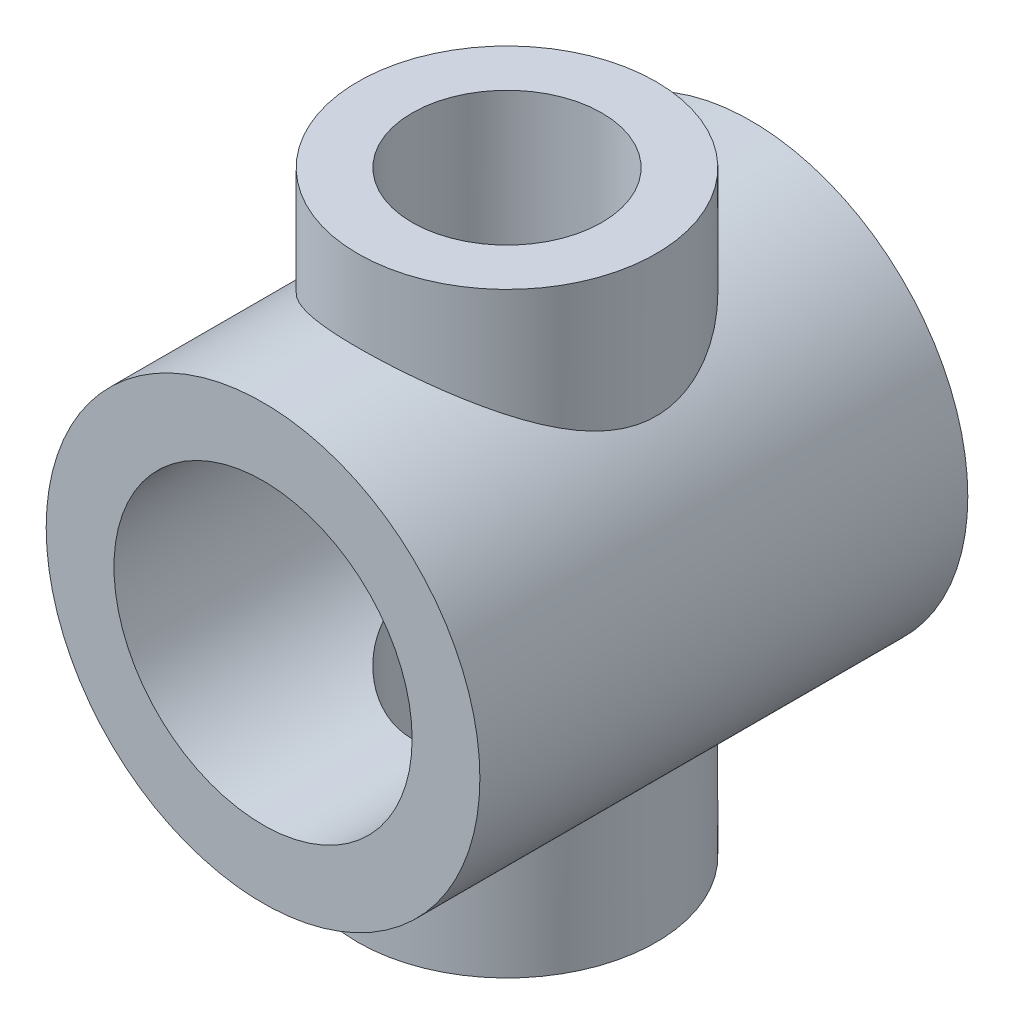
ISO-10303-21;
HEADER;
FILE_DESCRIPTION(('STEP AP214'),'2;1');
FILE_NAME('part.step','',(''),(''),'','','');
FILE_SCHEMA(('AUTOMOTIVE_DESIGN { 1 0 10303 214 1 1 1 1 }'));
ENDSEC;
DATA;
#1=APPLICATION_CONTEXT('core data for automotive mechanical design processes');
#2=APPLICATION_PROTOCOL_DEFINITION('international standard','automotive_design',2000,#1);
#3=PRODUCT_CONTEXT('',#1,'mechanical');
#4=PRODUCT('Part','Part','',(#3));
#5=PRODUCT_RELATED_PRODUCT_CATEGORY('part','',(#4));
#6=PRODUCT_DEFINITION_FORMATION('','',#4);
#7=PRODUCT_DEFINITION_CONTEXT('part definition',#1,'design');
#8=PRODUCT_DEFINITION('design','',#6,#7);
#9=PRODUCT_DEFINITION_SHAPE('','',#8);
#10=(LENGTH_UNIT() NAMED_UNIT(*) SI_UNIT(.MILLI.,.METRE.));
#11=(NAMED_UNIT(*) PLANE_ANGLE_UNIT() SI_UNIT($,.RADIAN.));
#12=(NAMED_UNIT(*) SI_UNIT($,.STERADIAN.) SOLID_ANGLE_UNIT());
#13=UNCERTAINTY_MEASURE_WITH_UNIT(LENGTH_MEASURE(1.E-05),#10,'distance_accuracy_value','');
#14=(GEOMETRIC_REPRESENTATION_CONTEXT(3) GLOBAL_UNCERTAINTY_ASSIGNED_CONTEXT((#13)) GLOBAL_UNIT_ASSIGNED_CONTEXT((#10,
#11,#12)) REPRESENTATION_CONTEXT('',''));
#15=CARTESIAN_POINT('',(0.,0.,0.));
#16=DIRECTION('',(0.,0.,1.));
#17=DIRECTION('',(1.,0.,0.));
#18=AXIS2_PLACEMENT_3D('',#15,#16,#17);
#19=CARTESIAN_POINT('',(0.,0.,18.));
#20=DIRECTION('',(0.,0.,1.));
#21=DIRECTION('',(1.,0.,0.));
#22=AXIS2_PLACEMENT_3D('',#19,#20,#21);
#23=PLANE('',#22);
#24=CARTESIAN_POINT('',(0.,0.,18.));
#25=DIRECTION('',(0.,0.,1.));
#26=DIRECTION('',(1.,0.,0.));
#27=AXIS2_PLACEMENT_3D('',#24,#25,#26);
#28=CIRCLE('',#27,8.);
#29=CARTESIAN_POINT('',(8.,0.,18.));
#30=VERTEX_POINT('',#29);
#31=EDGE_CURVE('E47',#30,#30,#28,.T.);
#32=ORIENTED_EDGE('',*,*,#31,.T.);
#33=EDGE_LOOP('',(#32));
#34=FACE_BOUND('',#33,.T.);
#35=CARTESIAN_POINT('',(0.,0.,18.));
#36=DIRECTION('',(0.,0.,1.));
#37=DIRECTION('',(1.,0.,0.));
#38=AXIS2_PLACEMENT_3D('',#35,#36,#37);
#39=CIRCLE('',#38,5.5);
#40=CARTESIAN_POINT('',(5.5,0.,18.));
#41=VERTEX_POINT('',#40);
#42=EDGE_CURVE('E91',#41,#41,#39,.F.);
#43=ORIENTED_EDGE('',*,*,#42,.T.);
#44=EDGE_LOOP('',(#43));
#45=FACE_BOUND('',#44,.T.);
#46=ADVANCED_FACE('F29',(#34,#45),#23,.T.);
#47=CARTESIAN_POINT('',(0.,0.,0.));
#48=DIRECTION('',(0.,0.,1.));
#49=DIRECTION('',(1.,0.,0.));
#50=AXIS2_PLACEMENT_3D('',#47,#48,#49);
#51=PLANE('',#50);
#52=CARTESIAN_POINT('',(0.,0.,0.));
#53=DIRECTION('',(0.,0.,1.));
#54=DIRECTION('',(1.,0.,0.));
#55=AXIS2_PLACEMENT_3D('',#52,#53,#54);
#56=CIRCLE('',#55,8.);
#57=CARTESIAN_POINT('',(8.,0.,0.));
#58=VERTEX_POINT('',#57);
#59=EDGE_CURVE('E82',#58,#58,#56,.T.);
#60=ORIENTED_EDGE('',*,*,#59,.F.);
#61=EDGE_LOOP('',(#60));
#62=FACE_BOUND('',#61,.T.);
#63=CARTESIAN_POINT('',(0.,0.,0.));
#64=DIRECTION('',(0.,0.,1.));
#65=DIRECTION('',(1.,0.,0.));
#66=AXIS2_PLACEMENT_3D('',#63,#64,#65);
#67=CIRCLE('',#66,5.5);
#68=CARTESIAN_POINT('',(5.5,0.,0.));
#69=VERTEX_POINT('',#68);
#70=EDGE_CURVE('E85',#69,#69,#67,.T.);
#71=ORIENTED_EDGE('',*,*,#70,.T.);
#72=EDGE_LOOP('',(#71));
#73=FACE_BOUND('',#72,.T.);
#74=ADVANCED_FACE('F69',(#62,#73),#51,.F.);
#75=CARTESIAN_POINT('',(0.,16.,9.));
#76=DIRECTION('',(0.,-1.,0.));
#77=DIRECTION('',(0.,0.,-1.));
#78=AXIS2_PLACEMENT_3D('',#75,#76,#77);
#79=CYLINDRICAL_SURFACE('',#78,3.5);
#80=CARTESIAN_POINT('',(0.,11.,9.));
#81=DIRECTION('',(0.,1.,0.));
#82=DIRECTION('',(0.,0.,1.));
#83=AXIS2_PLACEMENT_3D('',#80,#81,#82);
#84=CIRCLE('',#83,3.5);
#85=CARTESIAN_POINT('',(0.,11.,12.5));
#86=VERTEX_POINT('',#85);
#87=EDGE_CURVE('E56',#86,#86,#84,.F.);
#88=ORIENTED_EDGE('',*,*,#87,.F.);
#89=EDGE_LOOP('',(#88));
#90=FACE_BOUND('',#89,.T.);
#91=CARTESIAN_POINT('',(0.,5.5,5.5));
#92=CARTESIAN_POINT('',(0.088668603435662,5.50000008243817,5.49999990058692));
#93=CARTESIAN_POINT('',(0.177336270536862,5.49785112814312,5.50337387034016));
#94=CARTESIAN_POINT('',(0.35398798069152,5.48930931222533,5.51681993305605));
#95=CARTESIAN_POINT('',(0.441971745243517,5.48291480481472,5.52689462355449));
#96=CARTESIAN_POINT('',(0.616651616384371,5.4660265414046,5.55361720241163));
#97=CARTESIAN_POINT('',(0.703345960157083,5.45552762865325,5.5702733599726));
#98=CARTESIAN_POINT('',(0.874723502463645,5.43068827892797,5.60992482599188));
#99=CARTESIAN_POINT('',(0.959405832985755,5.41634621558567,5.63292281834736));
#100=CARTESIAN_POINT('',(1.20866950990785,5.36819841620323,5.71073859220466));
#101=CARTESIAN_POINT('',(1.36954145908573,5.32916121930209,5.77454692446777));
#102=CARTESIAN_POINT('',(1.67761743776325,5.2403620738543,5.92348333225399));
#103=CARTESIAN_POINT('',(1.82482247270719,5.19060091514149,6.0086098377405));
#104=CARTESIAN_POINT('',(2.11504296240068,5.07962805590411,6.20540306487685));
#105=CARTESIAN_POINT('',(2.25674426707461,5.01781426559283,6.31866509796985));
#106=CARTESIAN_POINT('',(2.5204037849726,4.89071017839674,6.56480711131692));
#107=CARTESIAN_POINT('',(2.64233436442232,4.82541518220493,6.69771406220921));
#108=CARTESIAN_POINT('',(2.88057352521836,4.68761830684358,7.00133879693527));
#109=CARTESIAN_POINT('',(2.99364844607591,4.6154031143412,7.17474570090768));
#110=CARTESIAN_POINT('',(3.18876354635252,4.48282648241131,7.54230098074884));
#111=CARTESIAN_POINT('',(3.27085680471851,4.42244485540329,7.73641314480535));
#112=CARTESIAN_POINT('',(3.38247193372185,4.33733050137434,8.08724886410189));
#113=CARTESIAN_POINT('',(3.42018119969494,4.3073828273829,8.24009286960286));
#114=CARTESIAN_POINT('',(3.47474629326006,4.26349663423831,8.55161284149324));
#115=CARTESIAN_POINT('',(3.49163325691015,4.24953421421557,8.71027973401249));
#116=CARTESIAN_POINT('',(3.50352792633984,4.2397366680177,9.02948921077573));
#117=CARTESIAN_POINT('',(3.49847060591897,4.24395541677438,9.1900359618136));
#118=CARTESIAN_POINT('',(3.46668215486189,4.26995361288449,9.5075649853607));
#119=CARTESIAN_POINT('',(3.43993325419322,4.29174745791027,9.66454422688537));
#120=CARTESIAN_POINT('',(3.36739264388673,4.34887279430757,9.9665079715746));
#121=CARTESIAN_POINT('',(3.32215570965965,4.38380771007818,10.1117053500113));
#122=CARTESIAN_POINT('',(3.21450524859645,4.46334231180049,10.3927034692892));
#123=CARTESIAN_POINT('',(3.15208598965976,4.50794522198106,10.5285010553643));
#124=CARTESIAN_POINT('',(2.99810117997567,4.61211256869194,10.8145527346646));
#125=CARTESIAN_POINT('',(2.90324164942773,4.67290582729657,10.9625843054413));
#126=CARTESIAN_POINT('',(2.6930915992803,4.79710231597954,11.242300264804));
#127=CARTESIAN_POINT('',(2.57777706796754,4.86050854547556,11.3739651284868));
#128=CARTESIAN_POINT('',(2.30583053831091,4.99601149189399,11.6411465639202));
#129=CARTESIAN_POINT('',(2.14549762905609,5.06764464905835,11.7731724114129));
#130=CARTESIAN_POINT('',(1.80093670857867,5.20005500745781,12.0083201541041));
#131=CARTESIAN_POINT('',(1.61673485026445,5.26084391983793,12.1114732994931));
#132=CARTESIAN_POINT('',(1.26705943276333,5.35448908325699,12.2670449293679));
#133=CARTESIAN_POINT('',(1.10509863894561,5.39049279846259,12.3254647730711));
#134=CARTESIAN_POINT('',(0.771986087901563,5.44816731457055,12.418165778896));
#135=CARTESIAN_POINT('',(0.600841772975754,5.46984953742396,12.4524661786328));
#136=CARTESIAN_POINT('',(0.253479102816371,5.4969246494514,12.4952050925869));
#137=CARTESIAN_POINT('',(0.0772461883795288,5.50226488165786,12.503560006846));
#138=CARTESIAN_POINT('',(-0.274174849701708,5.49597220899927,12.4936693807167));
#139=CARTESIAN_POINT('',(-0.449362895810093,5.48433805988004,12.4754218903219));
#140=CARTESIAN_POINT('',(-0.784463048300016,5.44624957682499,12.4149880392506));
#141=CARTESIAN_POINT('',(-0.944698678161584,5.42058062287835,12.3740688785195));
#142=CARTESIAN_POINT('',(-1.25563623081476,5.3571058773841,12.2711193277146));
#143=CARTESIAN_POINT('',(-1.40633654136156,5.31929803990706,12.2090853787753));
#144=CARTESIAN_POINT('',(-1.70652898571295,5.23106686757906,12.0607008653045));
#145=CARTESIAN_POINT('',(-1.85506429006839,5.17990468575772,11.9728639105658));
#146=CARTESIAN_POINT('',(-2.13602585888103,5.07051967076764,11.7778925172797));
#147=CARTESIAN_POINT('',(-2.26843914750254,5.01229122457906,11.6707427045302));
#148=CARTESIAN_POINT('',(-2.53447291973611,4.88379191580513,11.4216729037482));
#149=CARTESIAN_POINT('',(-2.66523578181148,4.8130332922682,11.2769444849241));
#150=CARTESIAN_POINT('',(-2.90158167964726,4.67435535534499,10.9669385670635));
#151=CARTESIAN_POINT('',(-3.00716132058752,4.60643642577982,10.8016583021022));
#152=CARTESIAN_POINT('',(-3.17751005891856,4.4902705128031,10.4771598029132));
#153=CARTESIAN_POINT('',(-3.24594376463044,4.44059968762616,10.3204075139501));
#154=CARTESIAN_POINT('',(-3.33139037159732,4.37642621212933,10.0766884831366));
#155=CARTESIAN_POINT('',(-3.35700338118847,4.35675877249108,9.99402658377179));
#156=CARTESIAN_POINT('',(-3.40218939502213,4.32156554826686,9.82622422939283));
#157=CARTESIAN_POINT('',(-3.42176535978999,4.30603773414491,9.74108501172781));
#158=CARTESIAN_POINT('',(-3.45473439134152,4.27963354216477,9.56801845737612));
#159=CARTESIAN_POINT('',(-3.46806529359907,4.26880400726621,9.48007202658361));
#160=CARTESIAN_POINT('',(-3.48800076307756,4.25253069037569,9.30296374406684));
#161=CARTESIAN_POINT('',(-3.49460872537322,4.24708418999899,9.21380252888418));
#162=CARTESIAN_POINT('',(-3.5009651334,4.2418466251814,9.03508778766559));
#163=CARTESIAN_POINT('',(-3.50071552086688,4.24205395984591,8.94553437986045));
#164=CARTESIAN_POINT('',(-3.4933764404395,4.24809784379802,8.76692843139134));
#165=CARTESIAN_POINT('',(-3.48628746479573,4.25393398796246,8.67787585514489));
#166=CARTESIAN_POINT('',(-3.45784465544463,4.27713646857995,8.4371896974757));
#167=CARTESIAN_POINT('',(-3.42988773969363,4.29978471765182,8.28678160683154));
#168=CARTESIAN_POINT('',(-3.35552745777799,4.35805222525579,7.99329374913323));
#169=CARTESIAN_POINT('',(-3.30910629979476,4.39368399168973,7.85022120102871));
#170=CARTESIAN_POINT('',(-3.18061171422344,4.48798778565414,7.52562386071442));
#171=CARTESIAN_POINT('',(-3.09176409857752,4.5503678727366,7.3478528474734));
#172=CARTESIAN_POINT('',(-2.88713957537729,4.68287158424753,7.01171982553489));
#173=CARTESIAN_POINT('',(-2.77132653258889,4.75300553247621,6.85338430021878));
#174=CARTESIAN_POINT('',(-2.51365586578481,4.89422020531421,6.55652140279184));
#175=CARTESIAN_POINT('',(-2.37152263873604,4.96530277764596,6.41823418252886));
#176=CARTESIAN_POINT('',(-2.06384330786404,5.10085482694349,6.16627609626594));
#177=CARTESIAN_POINT('',(-1.89829729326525,5.16532432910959,6.05260513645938));
#178=CARTESIAN_POINT('',(-1.63241263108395,5.25302861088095,5.90225892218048));
#179=CARTESIAN_POINT('',(-1.53949582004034,5.28107349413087,5.85501633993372));
#180=CARTESIAN_POINT('',(-1.34885332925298,5.33294738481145,5.76866503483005));
#181=CARTESIAN_POINT('',(-1.251130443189,5.35677880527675,5.72955165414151));
#182=CARTESIAN_POINT('',(-1.05182946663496,5.39944616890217,5.66012492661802));
#183=CARTESIAN_POINT('',(-0.950261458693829,5.41829426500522,5.62979015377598));
#184=CARTESIAN_POINT('',(-0.74401504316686,5.45044196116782,5.57834506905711));
#185=CARTESIAN_POINT('',(-0.639338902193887,5.46374550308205,5.55722820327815));
#186=CARTESIAN_POINT('',(-0.445661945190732,5.48262773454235,5.52734754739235));
#187=CARTESIAN_POINT('',(-0.356975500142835,5.48912762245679,5.51710621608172));
#188=CARTESIAN_POINT('',(-0.178859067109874,5.49781377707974,5.50343239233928));
#189=CARTESIAN_POINT('',(-0.0894290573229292,5.49999991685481,5.50000010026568));
#190=CARTESIAN_POINT('',(0.,5.5,5.5));
#191=B_SPLINE_CURVE_WITH_KNOTS('',3,(#91,#92,#93,#94,#95,#96,#97,#98,#99,#100,#101,#102,#103,
#104,#105,#106,#107,#108,#109,#110,#111,#112,#113,#114,#115,#116,#117,#118,#119,#120,#121,#122,
#123,#124,#125,#126,#127,#128,#129,#130,#131,#132,#133,#134,#135,#136,#137,#138,#139,#140,#141,
#142,#143,#144,#145,#146,#147,#148,#149,#150,#151,#152,#153,#154,#155,#156,#157,#158,#159,#160,
#161,#162,#163,#164,#165,#166,#167,#168,#169,#170,#171,#172,#173,#174,#175,#176,#177,#178,#179,
#180,#181,#182,#183,#184,#185,#186,#187,#188,#189,#190),.UNSPECIFIED.,.T.,.F.,(4,2,2,2,2,2,2,2,
2,2,2,2,2,2,2,2,2,2,2,2,2,2,2,2,2,2,2,2,2,2,2,2,2,2,2,2,2,2,2,2,2,2,2,2,2,2,2,2,2,4),(0.,
0.265914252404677,0.531931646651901,0.798284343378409,1.06474993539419,1.59444535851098,
2.12410178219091,2.69682977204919,3.27035149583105,3.92498112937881,4.57848407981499,
5.05726289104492,5.53532490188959,6.01480449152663,6.49467727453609,6.96109947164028,
7.42767745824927,7.98374091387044,8.54046149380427,9.19633860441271,9.85150306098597,
10.3769507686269,10.9019789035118,11.4286970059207,11.9554537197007,12.4553692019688,
12.9553689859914,13.4932558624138,14.0315728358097,14.6514632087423,15.2714370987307,
15.8034651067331,16.0694207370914,16.3352457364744,16.6036633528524,16.8719453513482,
17.1401513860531,17.4083381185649,17.870104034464,18.3323159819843,18.9539188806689,
19.57635960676,20.2057300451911,20.8350980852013,21.1585188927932,21.4817538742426,
21.8041931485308,22.1264027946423,22.394589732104,22.6627845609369),.UNSPECIFIED.);
#192=CARTESIAN_POINT('',(0.,5.5,5.5));
#193=VERTEX_POINT('',#192);
#194=EDGE_CURVE('E34',#193,#193,#191,.T.);
#195=ORIENTED_EDGE('',*,*,#194,.T.);
#196=EDGE_LOOP('',(#195));
#197=FACE_BOUND('',#196,.T.);
#198=ADVANCED_FACE('F72',(#90,#197),#79,.F.);
#199=CARTESIAN_POINT('',(0.,-11.,9.));
#200=DIRECTION('',(0.,1.,0.));
#201=DIRECTION('',(0.,0.,1.));
#202=AXIS2_PLACEMENT_3D('',#199,#200,#201);
#203=CIRCLE('',#202,3.5);
#204=CARTESIAN_POINT('',(0.,-11.,12.5));
#205=VERTEX_POINT('',#204);
#206=EDGE_CURVE('E94',#205,#205,#203,.F.);
#207=ORIENTED_EDGE('',*,*,#206,.T.);
#208=EDGE_LOOP('',(#207));
#209=FACE_BOUND('',#208,.T.);
#210=CARTESIAN_POINT('',(0.,-5.5,5.5));
#211=CARTESIAN_POINT('',(-0.088668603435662,-5.50000008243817,5.49999990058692));
#212=CARTESIAN_POINT('',(-0.177336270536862,-5.49785112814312,5.50337387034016));
#213=CARTESIAN_POINT('',(-0.35398798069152,-5.48930931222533,5.51681993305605));
#214=CARTESIAN_POINT('',(-0.441971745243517,-5.48291480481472,5.52689462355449));
#215=CARTESIAN_POINT('',(-0.616651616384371,-5.4660265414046,5.55361720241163));
#216=CARTESIAN_POINT('',(-0.703345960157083,-5.45552762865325,5.5702733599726));
#217=CARTESIAN_POINT('',(-0.874723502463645,-5.43068827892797,5.60992482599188));
#218=CARTESIAN_POINT('',(-0.959405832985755,-5.41634621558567,5.63292281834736));
#219=CARTESIAN_POINT('',(-1.20866950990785,-5.36819841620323,5.71073859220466));
#220=CARTESIAN_POINT('',(-1.36954145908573,-5.32916121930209,5.77454692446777));
#221=CARTESIAN_POINT('',(-1.67761743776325,-5.2403620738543,5.92348333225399));
#222=CARTESIAN_POINT('',(-1.82482247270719,-5.19060091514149,6.0086098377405));
#223=CARTESIAN_POINT('',(-2.11504296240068,-5.07962805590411,6.20540306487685));
#224=CARTESIAN_POINT('',(-2.25674426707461,-5.01781426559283,6.31866509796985));
#225=CARTESIAN_POINT('',(-2.5204037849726,-4.89071017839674,6.56480711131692));
#226=CARTESIAN_POINT('',(-2.64233436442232,-4.82541518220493,6.69771406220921));
#227=CARTESIAN_POINT('',(-2.88057352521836,-4.68761830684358,7.00133879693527));
#228=CARTESIAN_POINT('',(-2.99364844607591,-4.6154031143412,7.17474570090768));
#229=CARTESIAN_POINT('',(-3.18876354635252,-4.48282648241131,7.54230098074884));
#230=CARTESIAN_POINT('',(-3.27085680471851,-4.42244485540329,7.73641314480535));
#231=CARTESIAN_POINT('',(-3.38247193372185,-4.33733050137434,8.08724886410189));
#232=CARTESIAN_POINT('',(-3.42018119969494,-4.3073828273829,8.24009286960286));
#233=CARTESIAN_POINT('',(-3.47474629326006,-4.26349663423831,8.55161284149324));
#234=CARTESIAN_POINT('',(-3.49163325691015,-4.24953421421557,8.71027973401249));
#235=CARTESIAN_POINT('',(-3.50352792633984,-4.2397366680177,9.02948921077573));
#236=CARTESIAN_POINT('',(-3.49847060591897,-4.24395541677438,9.1900359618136));
#237=CARTESIAN_POINT('',(-3.46668215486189,-4.26995361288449,9.5075649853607));
#238=CARTESIAN_POINT('',(-3.43993325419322,-4.29174745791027,9.66454422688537));
#239=CARTESIAN_POINT('',(-3.36739264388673,-4.34887279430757,9.9665079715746));
#240=CARTESIAN_POINT('',(-3.32215570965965,-4.38380771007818,10.1117053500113));
#241=CARTESIAN_POINT('',(-3.21450524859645,-4.46334231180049,10.3927034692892));
#242=CARTESIAN_POINT('',(-3.15208598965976,-4.50794522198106,10.5285010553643));
#243=CARTESIAN_POINT('',(-2.99810117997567,-4.61211256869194,10.8145527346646));
#244=CARTESIAN_POINT('',(-2.90324164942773,-4.67290582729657,10.9625843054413));
#245=CARTESIAN_POINT('',(-2.6930915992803,-4.79710231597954,11.242300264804));
#246=CARTESIAN_POINT('',(-2.57777706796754,-4.86050854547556,11.3739651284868));
#247=CARTESIAN_POINT('',(-2.30583053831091,-4.99601149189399,11.6411465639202));
#248=CARTESIAN_POINT('',(-2.14549762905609,-5.06764464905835,11.7731724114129));
#249=CARTESIAN_POINT('',(-1.80093670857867,-5.20005500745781,12.0083201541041));
#250=CARTESIAN_POINT('',(-1.61673485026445,-5.26084391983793,12.1114732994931));
#251=CARTESIAN_POINT('',(-1.26705943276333,-5.35448908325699,12.2670449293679));
#252=CARTESIAN_POINT('',(-1.10509863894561,-5.39049279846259,12.3254647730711));
#253=CARTESIAN_POINT('',(-0.771986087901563,-5.44816731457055,12.418165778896));
#254=CARTESIAN_POINT('',(-0.600841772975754,-5.46984953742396,12.4524661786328));
#255=CARTESIAN_POINT('',(-0.253479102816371,-5.4969246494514,12.4952050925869));
#256=CARTESIAN_POINT('',(-0.0772461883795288,-5.50226488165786,12.503560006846));
#257=CARTESIAN_POINT('',(0.274174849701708,-5.49597220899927,12.4936693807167));
#258=CARTESIAN_POINT('',(0.449362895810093,-5.48433805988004,12.4754218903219));
#259=CARTESIAN_POINT('',(0.784463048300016,-5.44624957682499,12.4149880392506));
#260=CARTESIAN_POINT('',(0.944698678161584,-5.42058062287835,12.3740688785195));
#261=CARTESIAN_POINT('',(1.25563623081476,-5.3571058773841,12.2711193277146));
#262=CARTESIAN_POINT('',(1.40633654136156,-5.31929803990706,12.2090853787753));
#263=CARTESIAN_POINT('',(1.70652898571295,-5.23106686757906,12.0607008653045));
#264=CARTESIAN_POINT('',(1.85506429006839,-5.17990468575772,11.9728639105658));
#265=CARTESIAN_POINT('',(2.13602585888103,-5.07051967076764,11.7778925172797));
#266=CARTESIAN_POINT('',(2.26843914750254,-5.01229122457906,11.6707427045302));
#267=CARTESIAN_POINT('',(2.53447291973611,-4.88379191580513,11.4216729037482));
#268=CARTESIAN_POINT('',(2.66523578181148,-4.8130332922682,11.2769444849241));
#269=CARTESIAN_POINT('',(2.90158167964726,-4.67435535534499,10.9669385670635));
#270=CARTESIAN_POINT('',(3.00716132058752,-4.60643642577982,10.8016583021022));
#271=CARTESIAN_POINT('',(3.17751005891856,-4.4902705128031,10.4771598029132));
#272=CARTESIAN_POINT('',(3.24594376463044,-4.44059968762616,10.3204075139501));
#273=CARTESIAN_POINT('',(3.33139037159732,-4.37642621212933,10.0766884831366));
#274=CARTESIAN_POINT('',(3.35700338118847,-4.35675877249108,9.99402658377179));
#275=CARTESIAN_POINT('',(3.40218939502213,-4.32156554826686,9.82622422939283));
#276=CARTESIAN_POINT('',(3.42176535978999,-4.30603773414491,9.74108501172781));
#277=CARTESIAN_POINT('',(3.45473439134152,-4.27963354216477,9.56801845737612));
#278=CARTESIAN_POINT('',(3.46806529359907,-4.26880400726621,9.48007202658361));
#279=CARTESIAN_POINT('',(3.48800076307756,-4.25253069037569,9.30296374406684));
#280=CARTESIAN_POINT('',(3.49460872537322,-4.24708418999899,9.21380252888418));
#281=CARTESIAN_POINT('',(3.5009651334,-4.2418466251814,9.03508778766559));
#282=CARTESIAN_POINT('',(3.50071552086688,-4.24205395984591,8.94553437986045));
#283=CARTESIAN_POINT('',(3.4933764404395,-4.24809784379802,8.76692843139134));
#284=CARTESIAN_POINT('',(3.48628746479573,-4.25393398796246,8.67787585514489));
#285=CARTESIAN_POINT('',(3.45784465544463,-4.27713646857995,8.4371896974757));
#286=CARTESIAN_POINT('',(3.42988773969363,-4.29978471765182,8.28678160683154));
#287=CARTESIAN_POINT('',(3.35552745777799,-4.35805222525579,7.99329374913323));
#288=CARTESIAN_POINT('',(3.30910629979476,-4.39368399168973,7.85022120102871));
#289=CARTESIAN_POINT('',(3.18061171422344,-4.48798778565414,7.52562386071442));
#290=CARTESIAN_POINT('',(3.09176409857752,-4.5503678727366,7.3478528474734));
#291=CARTESIAN_POINT('',(2.88713957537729,-4.68287158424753,7.01171982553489));
#292=CARTESIAN_POINT('',(2.77132653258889,-4.75300553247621,6.85338430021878));
#293=CARTESIAN_POINT('',(2.51365586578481,-4.89422020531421,6.55652140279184));
#294=CARTESIAN_POINT('',(2.37152263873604,-4.96530277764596,6.41823418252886));
#295=CARTESIAN_POINT('',(2.06384330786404,-5.10085482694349,6.16627609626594));
#296=CARTESIAN_POINT('',(1.89829729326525,-5.16532432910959,6.05260513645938));
#297=CARTESIAN_POINT('',(1.63241263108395,-5.25302861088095,5.90225892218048));
#298=CARTESIAN_POINT('',(1.53949582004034,-5.28107349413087,5.85501633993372));
#299=CARTESIAN_POINT('',(1.34885332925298,-5.33294738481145,5.76866503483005));
#300=CARTESIAN_POINT('',(1.251130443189,-5.35677880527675,5.72955165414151));
#301=CARTESIAN_POINT('',(1.05182946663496,-5.39944616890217,5.66012492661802));
#302=CARTESIAN_POINT('',(0.950261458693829,-5.41829426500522,5.62979015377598));
#303=CARTESIAN_POINT('',(0.74401504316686,-5.45044196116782,5.57834506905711));
#304=CARTESIAN_POINT('',(0.639338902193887,-5.46374550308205,5.55722820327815));
#305=CARTESIAN_POINT('',(0.445661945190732,-5.48262773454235,5.52734754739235));
#306=CARTESIAN_POINT('',(0.356975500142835,-5.48912762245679,5.51710621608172));
#307=CARTESIAN_POINT('',(0.178859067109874,-5.49781377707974,5.50343239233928));
#308=CARTESIAN_POINT('',(0.0894290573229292,-5.49999991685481,5.50000010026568));
#309=CARTESIAN_POINT('',(0.,-5.5,5.5));
#310=B_SPLINE_CURVE_WITH_KNOTS('',3,(#210,#211,#212,#213,#214,#215,#216,#217,#218,#219,#220,
#221,#222,#223,#224,#225,#226,#227,#228,#229,#230,#231,#232,#233,#234,#235,#236,#237,#238,#239,
#240,#241,#242,#243,#244,#245,#246,#247,#248,#249,#250,#251,#252,#253,#254,#255,#256,#257,#258,
#259,#260,#261,#262,#263,#264,#265,#266,#267,#268,#269,#270,#271,#272,#273,#274,#275,#276,#277,
#278,#279,#280,#281,#282,#283,#284,#285,#286,#287,#288,#289,#290,#291,#292,#293,#294,#295,#296,
#297,#298,#299,#300,#301,#302,#303,#304,#305,#306,#307,#308,#309),.UNSPECIFIED.,.T.,.F.,(4,2,2,
2,2,2,2,2,2,2,2,2,2,2,2,2,2,2,2,2,2,2,2,2,2,2,2,2,2,2,2,2,2,2,2,2,2,2,2,2,2,2,2,2,2,2,2,2,2,4),
(0.,0.265914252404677,0.531931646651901,0.798284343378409,1.06474993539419,1.59444535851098,
2.12410178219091,2.69682977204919,3.27035149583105,3.92498112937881,4.57848407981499,
5.05726289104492,5.53532490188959,6.01480449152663,6.49467727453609,6.96109947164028,
7.42767745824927,7.98374091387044,8.54046149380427,9.19633860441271,9.85150306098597,
10.3769507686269,10.9019789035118,11.4286970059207,11.9554537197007,12.4553692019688,
12.9553689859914,13.4932558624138,14.0315728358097,14.6514632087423,15.2714370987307,
15.8034651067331,16.0694207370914,16.3352457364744,16.6036633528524,16.8719453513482,
17.1401513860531,17.4083381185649,17.870104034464,18.3323159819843,18.9539188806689,
19.57635960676,20.2057300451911,20.8350980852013,21.1585188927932,21.4817538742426,
21.8041931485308,22.1264027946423,22.394589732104,22.6627845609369),.UNSPECIFIED.);
#311=CARTESIAN_POINT('',(0.,-5.5,5.5));
#312=VERTEX_POINT('',#311);
#313=EDGE_CURVE('E87',#312,#312,#310,.T.);
#314=ORIENTED_EDGE('',*,*,#313,.T.);
#315=EDGE_LOOP('',(#314));
#316=FACE_BOUND('',#315,.T.);
#317=ADVANCED_FACE('F77',(#209,#316),#79,.F.);
#318=CARTESIAN_POINT('',(0.,-11.,9.));
#319=DIRECTION('',(0.,1.,0.));
#320=DIRECTION('',(0.,0.,1.));
#321=AXIS2_PLACEMENT_3D('',#318,#319,#320);
#322=PLANE('',#321);
#323=CARTESIAN_POINT('',(0.,-11.,9.));
#324=DIRECTION('',(0.,1.,0.));
#325=DIRECTION('',(0.,0.,1.));
#326=AXIS2_PLACEMENT_3D('',#323,#324,#325);
#327=CIRCLE('',#326,5.5);
#328=CARTESIAN_POINT('',(0.,-11.,14.5));
#329=VERTEX_POINT('',#328);
#330=EDGE_CURVE('E97',#329,#329,#327,.T.);
#331=ORIENTED_EDGE('',*,*,#330,.F.);
#332=EDGE_LOOP('',(#331));
#333=FACE_BOUND('',#332,.T.);
#334=ORIENTED_EDGE('',*,*,#206,.F.);
#335=EDGE_LOOP('',(#334));
#336=FACE_BOUND('',#335,.T.);
#337=ADVANCED_FACE('F65',(#333,#336),#322,.F.);
#338=CARTESIAN_POINT('',(0.,11.,9.));
#339=DIRECTION('',(0.,1.,0.));
#340=DIRECTION('',(0.,0.,1.));
#341=AXIS2_PLACEMENT_3D('',#338,#339,#340);
#342=PLANE('',#341);
#343=CARTESIAN_POINT('',(0.,11.,9.));
#344=DIRECTION('',(0.,1.,0.));
#345=DIRECTION('',(0.,0.,1.));
#346=AXIS2_PLACEMENT_3D('',#343,#344,#345);
#347=CIRCLE('',#346,5.5);
#348=CARTESIAN_POINT('',(0.,11.,14.5));
#349=VERTEX_POINT('',#348);
#350=EDGE_CURVE('E98',#349,#349,#347,.T.);
#351=ORIENTED_EDGE('',*,*,#350,.T.);
#352=EDGE_LOOP('',(#351));
#353=FACE_BOUND('',#352,.T.);
#354=ORIENTED_EDGE('',*,*,#87,.T.);
#355=EDGE_LOOP('',(#354));
#356=FACE_BOUND('',#355,.T.);
#357=ADVANCED_FACE('F107',(#353,#356),#342,.T.);
#358=CARTESIAN_POINT('',(0.,0.,18.));
#359=DIRECTION('',(0.,0.,-1.));
#360=DIRECTION('',(-1.,0.,0.));
#361=AXIS2_PLACEMENT_3D('',#358,#359,#360);
#362=CYLINDRICAL_SURFACE('',#361,8.);
#363=CARTESIAN_POINT('',(0.,-8.,3.5));
#364=CARTESIAN_POINT('',(0.137266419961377,-7.99999987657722,3.50000012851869));
#365=CARTESIAN_POINT('',(0.274534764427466,-7.99645958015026,3.5051458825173));
#366=CARTESIAN_POINT('',(0.547943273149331,-7.98238674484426,3.52564585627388));
#367=CARTESIAN_POINT('',(0.684083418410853,-7.97185408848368,3.54100024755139));
#368=CARTESIAN_POINT('',(0.954192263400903,-7.94405156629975,3.58168147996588));
#369=CARTESIAN_POINT('',(1.08816047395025,-7.92678020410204,3.60701053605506));
#370=CARTESIAN_POINT('',(1.35297984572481,-7.88589932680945,3.66728044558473));
#371=CARTESIAN_POINT('',(1.48382964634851,-7.86228709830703,3.70222541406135));
#372=CARTESIAN_POINT('',(1.74083213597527,-7.80939299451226,3.78104710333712));
#373=CARTESIAN_POINT('',(1.86700623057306,-7.7801421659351,3.82487497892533));
#374=CARTESIAN_POINT('',(2.11473737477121,-7.71649352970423,3.92106641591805));
#375=CARTESIAN_POINT('',(2.23629259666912,-7.68209371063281,3.97343331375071));
#376=CARTESIAN_POINT('',(2.59307020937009,-7.57217048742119,4.14251588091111));
#377=CARTESIAN_POINT('',(2.82063002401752,-7.48987513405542,4.27128372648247));
#378=CARTESIAN_POINT('',(3.27066804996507,-7.30527689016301,4.56920629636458));
#379=CARTESIAN_POINT('',(3.49097725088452,-7.201855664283,4.74090184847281));
#380=CARTESIAN_POINT('',(3.90178342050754,-6.98782684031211,5.11372585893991));
#381=CARTESIAN_POINT('',(4.09223553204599,-6.87720877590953,5.31489774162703));
#382=CARTESIAN_POINT('',(4.36862185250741,-6.70296528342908,5.65466467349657));
#383=CARTESIAN_POINT('',(4.46513198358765,-6.63888776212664,5.78458541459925));
#384=CARTESIAN_POINT('',(4.64682921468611,-6.51300043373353,6.05325886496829));
#385=CARTESIAN_POINT('',(4.73201351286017,-6.45119119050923,6.19201374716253));
#386=CARTESIAN_POINT('',(4.89030116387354,-6.33204236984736,6.47778359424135));
#387=CARTESIAN_POINT('',(4.96342358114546,-6.27469581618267,6.62478502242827));
#388=CARTESIAN_POINT('',(5.09696884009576,-6.16670701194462,6.9267878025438));
#389=CARTESIAN_POINT('',(5.15739158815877,-6.11606481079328,7.08178921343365));
#390=CARTESIAN_POINT('',(5.28562320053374,-6.00599161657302,7.46167184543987));
#391=CARTESIAN_POINT('',(5.34703685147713,-5.95090176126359,7.69012036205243));
#392=CARTESIAN_POINT('',(5.41693530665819,-5.88708591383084,8.04030105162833));
#393=CARTESIAN_POINT('',(5.43652795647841,-5.86895370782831,8.15823394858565));
#394=CARTESIAN_POINT('',(5.46804253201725,-5.8396048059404,8.3959643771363));
#395=CARTESIAN_POINT('',(5.4799673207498,-5.82838552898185,8.51576119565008));
#396=CARTESIAN_POINT('',(5.49596558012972,-5.81330236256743,8.75698546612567));
#397=CARTESIAN_POINT('',(5.49999675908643,-5.80947809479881,8.87841821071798));
#398=CARTESIAN_POINT('',(5.50000323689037,-5.80947194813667,9.12128428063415));
#399=CARTESIAN_POINT('',(5.49597854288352,-5.81329006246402,9.2427176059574));
#400=CARTESIAN_POINT('',(5.47994768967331,-5.82840411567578,9.4846360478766));
#401=CARTESIAN_POINT('',(5.46793819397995,-5.83970318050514,9.60512074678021));
#402=CARTESIAN_POINT('',(5.43616344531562,-5.86929197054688,9.84421270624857));
#403=CARTESIAN_POINT('',(5.41639493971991,-5.88758462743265,9.96281915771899));
#404=CARTESIAN_POINT('',(5.34864197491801,-5.94942574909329,10.3010430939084));
#405=CARTESIAN_POINT('',(5.29115689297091,-6.00101168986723,10.5173645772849));
#406=CARTESIAN_POINT('',(5.15227529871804,-6.12065172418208,10.9373024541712));
#407=CARTESIAN_POINT('',(5.07086005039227,-6.18871871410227,11.140908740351));
#408=CARTESIAN_POINT('',(4.90919386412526,-6.31725428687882,11.485256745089));
#409=CARTESIAN_POINT('',(4.83362805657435,-6.37544321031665,11.6290987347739));
#410=CARTESIAN_POINT('',(4.67090265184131,-6.49560554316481,11.908400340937));
#411=CARTESIAN_POINT('',(4.58374271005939,-6.557579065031,12.0438597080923));
#412=CARTESIAN_POINT('',(4.39819265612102,-6.68344948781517,12.3063243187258));
#413=CARTESIAN_POINT('',(4.29978166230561,-6.74734979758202,12.4333131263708));
#414=CARTESIAN_POINT('',(4.09227177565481,-6.87518444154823,12.6781873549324));
#415=CARTESIAN_POINT('',(3.98317417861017,-6.93911877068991,12.7960738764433));
#416=CARTESIAN_POINT('',(3.75347594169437,-7.06603194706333,13.0234048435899));
#417=CARTESIAN_POINT('',(3.63277138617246,-7.12899489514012,13.1327533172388));
#418=CARTESIAN_POINT('',(3.38116315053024,-7.25171170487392,13.3410133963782));
#419=CARTESIAN_POINT('',(3.25026070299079,-7.3114659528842,13.4399262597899));
#420=CARTESIAN_POINT('',(2.97892919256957,-7.4261455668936,13.6263405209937));
#421=CARTESIAN_POINT('',(2.83851659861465,-7.48107892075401,13.7138609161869));
#422=CARTESIAN_POINT('',(2.54862267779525,-7.584734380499,13.8766933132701));
#423=CARTESIAN_POINT('',(2.3991440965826,-7.63345835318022,13.952008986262));
#424=CARTESIAN_POINT('',(2.12610532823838,-7.71331232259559,14.0741321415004));
#425=CARTESIAN_POINT('',(2.00414979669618,-7.74594770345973,14.123557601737));
#426=CARTESIAN_POINT('',(1.75587264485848,-7.80597279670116,14.2138613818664));
#427=CARTESIAN_POINT('',(1.62955197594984,-7.83336364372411,14.2547415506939));
#428=CARTESIAN_POINT('',(1.37329013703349,-7.88232721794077,14.3274576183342));
#429=CARTESIAN_POINT('',(1.24335068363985,-7.90390265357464,14.3592977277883));
#430=CARTESIAN_POINT('',(0.980628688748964,-7.94077833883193,14.4135345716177));
#431=CARTESIAN_POINT('',(0.847846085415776,-7.9560784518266,14.4359311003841));
#432=CARTESIAN_POINT('',(0.579909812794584,-7.98009151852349,14.4710168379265));
#433=CARTESIAN_POINT('',(0.444749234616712,-7.98878011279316,14.4836701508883));
#434=CARTESIAN_POINT('',(0.17359352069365,-7.99926705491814,14.4989366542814));
#435=CARTESIAN_POINT('',(0.0375983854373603,-8.0010654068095,14.5015498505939));
#436=CARTESIAN_POINT('',(-0.234128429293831,-7.99772754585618,14.4966943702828));
#437=CARTESIAN_POINT('',(-0.369860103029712,-7.99259118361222,14.4892254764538));
#438=CARTESIAN_POINT('',(-0.639966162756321,-7.97550985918,14.4643242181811));
#439=CARTESIAN_POINT('',(-0.774340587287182,-7.96356509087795,14.4468921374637));
#440=CARTESIAN_POINT('',(-1.03300361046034,-7.93403118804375,14.40361791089));
#441=CARTESIAN_POINT('',(-1.15742582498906,-7.91680874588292,14.3783209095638));
#442=CARTESIAN_POINT('',(-1.40342019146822,-7.87692633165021,14.3194390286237));
#443=CARTESIAN_POINT('',(-1.52499135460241,-7.85426450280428,14.285851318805));
#444=CARTESIAN_POINT('',(-1.88431514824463,-7.77875915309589,14.1732236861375));
#445=CARTESIAN_POINT('',(-2.11688002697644,-7.71837170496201,14.0822847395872));
#446=CARTESIAN_POINT('',(-2.5808963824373,-7.57643923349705,13.8641357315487));
#447=CARTESIAN_POINT('',(-2.81087757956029,-7.4936212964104,13.7346685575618));
#448=CARTESIAN_POINT('',(-3.24680165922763,-7.31531257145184,13.4470808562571));
#449=CARTESIAN_POINT('',(-3.4527272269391,-7.2198127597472,13.2889398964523));
#450=CARTESIAN_POINT('',(-3.87132112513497,-7.00550458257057,12.9183889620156));
#451=CARTESIAN_POINT('',(-4.07924157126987,-6.8854854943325,12.7013241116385));
#452=CARTESIAN_POINT('',(-4.45767290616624,-6.64673868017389,12.2356126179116));
#453=CARTESIAN_POINT('',(-4.62816238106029,-6.52801173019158,11.9869480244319));
#454=CARTESIAN_POINT('',(-4.84380627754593,-6.36744101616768,11.6086601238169));
#455=CARTESIAN_POINT('',(-4.90554891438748,-6.31988980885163,11.4906796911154));
#456=CARTESIAN_POINT('',(-5.02083091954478,-6.22869510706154,11.249255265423));
#457=CARTESIAN_POINT('',(-5.07436945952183,-6.18505200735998,11.1258107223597));
#458=CARTESIAN_POINT('',(-5.172662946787,-6.10308564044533,10.8739801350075));
#459=CARTESIAN_POINT('',(-5.2174307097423,-6.06475463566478,10.7456016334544));
#460=CARTESIAN_POINT('',(-5.29769958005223,-5.99476587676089,10.4842644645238));
#461=CARTESIAN_POINT('',(-5.33320654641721,-5.9631039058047,10.3513087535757));
#462=CARTESIAN_POINT('',(-5.38894978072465,-5.9127294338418,10.1055117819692));
#463=CARTESIAN_POINT('',(-5.41077870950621,-5.89271543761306,9.99329734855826));
#464=CARTESIAN_POINT('',(-5.447482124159,-5.85880240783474,9.76686505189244));
#465=CARTESIAN_POINT('',(-5.46235996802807,-5.84490042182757,9.65264818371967));
#466=CARTESIAN_POINT('',(-5.48492486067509,-5.82373081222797,9.42297019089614));
#467=CARTESIAN_POINT('',(-5.49261692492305,-5.81645856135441,9.30750999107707));
#468=CARTESIAN_POINT('',(-5.5006920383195,-5.80882242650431,9.07610184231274));
#469=CARTESIAN_POINT('',(-5.50107496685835,-5.80845865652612,8.96015388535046));
#470=CARTESIAN_POINT('',(-5.49452269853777,-5.8146576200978,8.72866773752));
#471=CARTESIAN_POINT('',(-5.48758865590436,-5.82121926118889,8.61312948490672));
#472=CARTESIAN_POINT('',(-5.46653306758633,-5.84099396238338,8.38326836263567));
#473=CARTESIAN_POINT('',(-5.45240906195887,-5.85420929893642,8.26894592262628));
#474=CARTESIAN_POINT('',(-5.39954564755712,-5.90316060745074,7.92878584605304));
#475=CARTESIAN_POINT('',(-5.35031745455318,-5.94819906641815,7.70583954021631));
#476=CARTESIAN_POINT('',(-5.20736893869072,-6.07410552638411,7.20544902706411));
#477=CARTESIAN_POINT('',(-5.10462333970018,-6.16173174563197,6.93232059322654));
#478=CARTESIAN_POINT('',(-4.92207151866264,-6.30708364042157,6.54154873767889));
#479=CARTESIAN_POINT('',(-4.85639062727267,-6.35791911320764,6.41431037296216));
#480=CARTESIAN_POINT('',(-4.71597898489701,-6.46275715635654,6.16630405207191));
#481=CARTESIAN_POINT('',(-4.64124882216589,-6.51675952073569,6.04553567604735));
#482=CARTESIAN_POINT('',(-4.40061245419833,-6.68379581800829,5.68816216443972));
#483=CARTESIAN_POINT('',(-4.22083124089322,-6.79971419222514,5.46196236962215));
#484=CARTESIAN_POINT('',(-3.92596286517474,-6.97135955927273,5.14544034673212));
#485=CARTESIAN_POINT('',(-3.82342021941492,-7.02822867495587,5.04368710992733));
#486=CARTESIAN_POINT('',(-3.61004986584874,-7.14017005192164,4.84807495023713));
#487=CARTESIAN_POINT('',(-3.49922082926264,-7.19524202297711,4.75421729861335));
#488=CARTESIAN_POINT('',(-3.25261212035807,-7.31038114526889,4.56170443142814));
#489=CARTESIAN_POINT('',(-3.11556524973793,-7.36998432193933,4.46438886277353));
#490=CARTESIAN_POINT('',(-2.83155594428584,-7.48369365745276,4.28186867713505));
#491=CARTESIAN_POINT('',(-2.68459805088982,-7.53780230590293,4.19665856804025));
#492=CARTESIAN_POINT('',(-2.38165111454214,-7.63892723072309,4.03947337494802));
#493=CARTESIAN_POINT('',(-2.22567242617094,-7.6859514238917,3.96748349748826));
#494=CARTESIAN_POINT('',(-1.90565844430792,-7.77147738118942,3.83780683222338));
#495=CARTESIAN_POINT('',(-1.74162640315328,-7.80998255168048,3.78011432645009));
#496=CARTESIAN_POINT('',(-1.44828258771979,-7.86886427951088,3.69247737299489));
#497=CARTESIAN_POINT('',(-1.32038319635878,-7.89136980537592,3.65919861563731));
#498=CARTESIAN_POINT('',(-1.06164857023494,-7.93032178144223,3.6018105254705));
#499=CARTESIAN_POINT('',(-0.930813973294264,-7.94676953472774,3.57769922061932));
#500=CARTESIAN_POINT('',(-0.667175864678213,-7.97323135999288,3.5389911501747));
#501=CARTESIAN_POINT('',(-0.534373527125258,-7.98324912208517,3.52438892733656));
#502=CARTESIAN_POINT('',(-0.267714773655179,-7.99663367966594,3.50489303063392));
#503=CARTESIAN_POINT('',(-0.133858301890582,-8.00000012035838,3.49999987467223));
#504=CARTESIAN_POINT('',(0.,-8.,3.5));
#505=B_SPLINE_CURVE_WITH_KNOTS('',3,(#363,#364,#365,#366,#367,#368,#369,#370,#371,#372,#373,
#374,#375,#376,#377,#378,#379,#380,#381,#382,#383,#384,#385,#386,#387,#388,#389,#390,#391,#392,
#393,#394,#395,#396,#397,#398,#399,#400,#401,#402,#403,#404,#405,#406,#407,#408,#409,#410,#411,
#412,#413,#414,#415,#416,#417,#418,#419,#420,#421,#422,#423,#424,#425,#426,#427,#428,#429,#430,
#431,#432,#433,#434,#435,#436,#437,#438,#439,#440,#441,#442,#443,#444,#445,#446,#447,#448,#449,
#450,#451,#452,#453,#454,#455,#456,#457,#458,#459,#460,#461,#462,#463,#464,#465,#466,#467,#468,
#469,#470,#471,#472,#473,#474,#475,#476,#477,#478,#479,#480,#481,#482,#483,#484,#485,#486,#487,
#488,#489,#490,#491,#492,#493,#494,#495,#496,#497,#498,#499,#500,#501,#502,#503,#504),
.UNSPECIFIED.,.T.,.F.,(4,2,2,2,2,2,2,2,2,2,2,2,2,2,2,2,2,2,2,2,2,2,2,2,2,2,2,2,2,2,2,2,2,2,2,2,
2,2,2,2,2,2,2,2,2,2,2,2,2,2,2,2,2,2,2,2,2,2,2,2,2,2,2,2,2,2,2,2,2,2,4),(0.,0.411661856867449,
0.823330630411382,1.23509086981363,1.64702759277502,2.05675779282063,2.46664847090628,
3.2857146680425,4.17612227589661,5.06785506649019,5.58954551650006,6.11136478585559,
6.6323512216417,7.15334149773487,7.87863512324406,8.24101211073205,8.60325371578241,
8.96743085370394,9.33160766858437,9.69593675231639,10.060418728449,10.7467806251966,
11.4336813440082,11.9508182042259,12.4679704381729,12.986098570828,13.5041639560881,
14.0273986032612,14.5505701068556,15.072857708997,15.5949879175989,16.0013132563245,
16.4075505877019,16.8135983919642,17.2196550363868,17.6272006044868,18.034745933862,
18.442300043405,18.8498425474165,19.2337976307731,19.6178839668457,20.3854447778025,
21.2122255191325,22.0395977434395,23.0068744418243,23.9747030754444,24.3985827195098,
24.8225051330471,25.2458034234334,25.6688332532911,26.0166473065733,26.3642931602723,
26.7116961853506,27.0591049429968,27.4064589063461,27.753931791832,28.4491268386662,
29.3580346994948,29.8135308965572,30.268997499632,31.1989975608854,31.6644323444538,
32.1299419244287,32.6642217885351,33.1982584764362,33.731693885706,34.2649156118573,
34.6666522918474,35.0683025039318,35.4697220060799,35.8711629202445),.UNSPECIFIED.);
#506=CARTESIAN_POINT('',(0.,-8.,3.5));
#507=VERTEX_POINT('',#506);
#508=EDGE_CURVE('E42',#507,#507,#505,.T.);
#509=ORIENTED_EDGE('',*,*,#508,.F.);
#510=EDGE_LOOP('',(#509));
#511=FACE_BOUND('',#510,.T.);
#512=ORIENTED_EDGE('',*,*,#31,.F.);
#513=EDGE_LOOP('',(#512));
#514=FACE_BOUND('',#513,.T.);
#515=ORIENTED_EDGE('',*,*,#59,.T.);
#516=EDGE_LOOP('',(#515));
#517=FACE_BOUND('',#516,.T.);
#518=CARTESIAN_POINT('',(0.,8.,3.5));
#519=CARTESIAN_POINT('',(-0.137266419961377,7.99999987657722,3.50000012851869));
#520=CARTESIAN_POINT('',(-0.274534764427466,7.99645958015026,3.5051458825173));
#521=CARTESIAN_POINT('',(-0.547943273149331,7.98238674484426,3.52564585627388));
#522=CARTESIAN_POINT('',(-0.684083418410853,7.97185408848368,3.54100024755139));
#523=CARTESIAN_POINT('',(-0.954192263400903,7.94405156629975,3.58168147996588));
#524=CARTESIAN_POINT('',(-1.08816047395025,7.92678020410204,3.60701053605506));
#525=CARTESIAN_POINT('',(-1.35297984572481,7.88589932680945,3.66728044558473));
#526=CARTESIAN_POINT('',(-1.48382964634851,7.86228709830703,3.70222541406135));
#527=CARTESIAN_POINT('',(-1.74083213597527,7.80939299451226,3.78104710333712));
#528=CARTESIAN_POINT('',(-1.86700623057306,7.7801421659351,3.82487497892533));
#529=CARTESIAN_POINT('',(-2.11473737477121,7.71649352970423,3.92106641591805));
#530=CARTESIAN_POINT('',(-2.23629259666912,7.68209371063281,3.97343331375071));
#531=CARTESIAN_POINT('',(-2.59307020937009,7.57217048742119,4.14251588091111));
#532=CARTESIAN_POINT('',(-2.82063002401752,7.48987513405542,4.27128372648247));
#533=CARTESIAN_POINT('',(-3.27066804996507,7.30527689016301,4.56920629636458));
#534=CARTESIAN_POINT('',(-3.49097725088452,7.201855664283,4.74090184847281));
#535=CARTESIAN_POINT('',(-3.90178342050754,6.98782684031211,5.11372585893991));
#536=CARTESIAN_POINT('',(-4.09223553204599,6.87720877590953,5.31489774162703));
#537=CARTESIAN_POINT('',(-4.36862185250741,6.70296528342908,5.65466467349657));
#538=CARTESIAN_POINT('',(-4.46513198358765,6.63888776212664,5.78458541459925));
#539=CARTESIAN_POINT('',(-4.64682921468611,6.51300043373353,6.05325886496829));
#540=CARTESIAN_POINT('',(-4.73201351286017,6.45119119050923,6.19201374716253));
#541=CARTESIAN_POINT('',(-4.89030116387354,6.33204236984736,6.47778359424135));
#542=CARTESIAN_POINT('',(-4.96342358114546,6.27469581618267,6.62478502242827));
#543=CARTESIAN_POINT('',(-5.09696884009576,6.16670701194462,6.9267878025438));
#544=CARTESIAN_POINT('',(-5.15739158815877,6.11606481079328,7.08178921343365));
#545=CARTESIAN_POINT('',(-5.28562320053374,6.00599161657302,7.46167184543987));
#546=CARTESIAN_POINT('',(-5.34703685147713,5.95090176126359,7.69012036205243));
#547=CARTESIAN_POINT('',(-5.41693530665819,5.88708591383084,8.04030105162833));
#548=CARTESIAN_POINT('',(-5.43652795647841,5.86895370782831,8.15823394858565));
#549=CARTESIAN_POINT('',(-5.46804253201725,5.8396048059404,8.3959643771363));
#550=CARTESIAN_POINT('',(-5.4799673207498,5.82838552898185,8.51576119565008));
#551=CARTESIAN_POINT('',(-5.49596558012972,5.81330236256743,8.75698546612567));
#552=CARTESIAN_POINT('',(-5.49999675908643,5.80947809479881,8.87841821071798));
#553=CARTESIAN_POINT('',(-5.50000323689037,5.80947194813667,9.12128428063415));
#554=CARTESIAN_POINT('',(-5.49597854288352,5.81329006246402,9.2427176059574));
#555=CARTESIAN_POINT('',(-5.47994768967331,5.82840411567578,9.4846360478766));
#556=CARTESIAN_POINT('',(-5.46793819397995,5.83970318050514,9.60512074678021));
#557=CARTESIAN_POINT('',(-5.43616344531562,5.86929197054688,9.84421270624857));
#558=CARTESIAN_POINT('',(-5.41639493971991,5.88758462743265,9.96281915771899));
#559=CARTESIAN_POINT('',(-5.34864197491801,5.94942574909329,10.3010430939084));
#560=CARTESIAN_POINT('',(-5.29115689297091,6.00101168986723,10.5173645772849));
#561=CARTESIAN_POINT('',(-5.15227529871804,6.12065172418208,10.9373024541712));
#562=CARTESIAN_POINT('',(-5.07086005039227,6.18871871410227,11.140908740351));
#563=CARTESIAN_POINT('',(-4.90919386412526,6.31725428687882,11.485256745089));
#564=CARTESIAN_POINT('',(-4.83362805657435,6.37544321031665,11.6290987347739));
#565=CARTESIAN_POINT('',(-4.67090265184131,6.49560554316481,11.908400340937));
#566=CARTESIAN_POINT('',(-4.58374271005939,6.557579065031,12.0438597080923));
#567=CARTESIAN_POINT('',(-4.39819265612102,6.68344948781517,12.3063243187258));
#568=CARTESIAN_POINT('',(-4.29978166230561,6.74734979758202,12.4333131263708));
#569=CARTESIAN_POINT('',(-4.09227177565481,6.87518444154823,12.6781873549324));
#570=CARTESIAN_POINT('',(-3.98317417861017,6.93911877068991,12.7960738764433));
#571=CARTESIAN_POINT('',(-3.75347594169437,7.06603194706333,13.0234048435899));
#572=CARTESIAN_POINT('',(-3.63277138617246,7.12899489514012,13.1327533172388));
#573=CARTESIAN_POINT('',(-3.38116315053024,7.25171170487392,13.3410133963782));
#574=CARTESIAN_POINT('',(-3.25026070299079,7.3114659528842,13.4399262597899));
#575=CARTESIAN_POINT('',(-2.97892919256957,7.4261455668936,13.6263405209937));
#576=CARTESIAN_POINT('',(-2.83851659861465,7.48107892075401,13.7138609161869));
#577=CARTESIAN_POINT('',(-2.54862267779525,7.584734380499,13.8766933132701));
#578=CARTESIAN_POINT('',(-2.3991440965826,7.63345835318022,13.952008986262));
#579=CARTESIAN_POINT('',(-2.12610532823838,7.71331232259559,14.0741321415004));
#580=CARTESIAN_POINT('',(-2.00414979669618,7.74594770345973,14.123557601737));
#581=CARTESIAN_POINT('',(-1.75587264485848,7.80597279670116,14.2138613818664));
#582=CARTESIAN_POINT('',(-1.62955197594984,7.83336364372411,14.2547415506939));
#583=CARTESIAN_POINT('',(-1.37329013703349,7.88232721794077,14.3274576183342));
#584=CARTESIAN_POINT('',(-1.24335068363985,7.90390265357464,14.3592977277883));
#585=CARTESIAN_POINT('',(-0.980628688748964,7.94077833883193,14.4135345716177));
#586=CARTESIAN_POINT('',(-0.847846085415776,7.9560784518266,14.4359311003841));
#587=CARTESIAN_POINT('',(-0.579909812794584,7.98009151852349,14.4710168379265));
#588=CARTESIAN_POINT('',(-0.444749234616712,7.98878011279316,14.4836701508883));
#589=CARTESIAN_POINT('',(-0.17359352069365,7.99926705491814,14.4989366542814));
#590=CARTESIAN_POINT('',(-0.0375983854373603,8.0010654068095,14.5015498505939));
#591=CARTESIAN_POINT('',(0.234128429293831,7.99772754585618,14.4966943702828));
#592=CARTESIAN_POINT('',(0.369860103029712,7.99259118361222,14.4892254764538));
#593=CARTESIAN_POINT('',(0.639966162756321,7.97550985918,14.4643242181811));
#594=CARTESIAN_POINT('',(0.774340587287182,7.96356509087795,14.4468921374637));
#595=CARTESIAN_POINT('',(1.03300361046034,7.93403118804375,14.40361791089));
#596=CARTESIAN_POINT('',(1.15742582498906,7.91680874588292,14.3783209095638));
#597=CARTESIAN_POINT('',(1.40342019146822,7.87692633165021,14.3194390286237));
#598=CARTESIAN_POINT('',(1.52499135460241,7.85426450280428,14.285851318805));
#599=CARTESIAN_POINT('',(1.88431514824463,7.77875915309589,14.1732236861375));
#600=CARTESIAN_POINT('',(2.11688002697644,7.71837170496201,14.0822847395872));
#601=CARTESIAN_POINT('',(2.5808963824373,7.57643923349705,13.8641357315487));
#602=CARTESIAN_POINT('',(2.81087757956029,7.4936212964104,13.7346685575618));
#603=CARTESIAN_POINT('',(3.24680165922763,7.31531257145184,13.4470808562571));
#604=CARTESIAN_POINT('',(3.4527272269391,7.2198127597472,13.2889398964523));
#605=CARTESIAN_POINT('',(3.87132112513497,7.00550458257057,12.9183889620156));
#606=CARTESIAN_POINT('',(4.07924157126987,6.8854854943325,12.7013241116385));
#607=CARTESIAN_POINT('',(4.45767290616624,6.64673868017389,12.2356126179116));
#608=CARTESIAN_POINT('',(4.62816238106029,6.52801173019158,11.9869480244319));
#609=CARTESIAN_POINT('',(4.84380627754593,6.36744101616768,11.6086601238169));
#610=CARTESIAN_POINT('',(4.90554891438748,6.31988980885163,11.4906796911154));
#611=CARTESIAN_POINT('',(5.02083091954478,6.22869510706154,11.249255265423));
#612=CARTESIAN_POINT('',(5.07436945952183,6.18505200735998,11.1258107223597));
#613=CARTESIAN_POINT('',(5.172662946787,6.10308564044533,10.8739801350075));
#614=CARTESIAN_POINT('',(5.2174307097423,6.06475463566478,10.7456016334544));
#615=CARTESIAN_POINT('',(5.29769958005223,5.99476587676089,10.4842644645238));
#616=CARTESIAN_POINT('',(5.33320654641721,5.9631039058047,10.3513087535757));
#617=CARTESIAN_POINT('',(5.38894978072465,5.9127294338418,10.1055117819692));
#618=CARTESIAN_POINT('',(5.41077870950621,5.89271543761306,9.99329734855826));
#619=CARTESIAN_POINT('',(5.447482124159,5.85880240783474,9.76686505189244));
#620=CARTESIAN_POINT('',(5.46235996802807,5.84490042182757,9.65264818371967));
#621=CARTESIAN_POINT('',(5.48492486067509,5.82373081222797,9.42297019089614));
#622=CARTESIAN_POINT('',(5.49261692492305,5.81645856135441,9.30750999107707));
#623=CARTESIAN_POINT('',(5.5006920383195,5.80882242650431,9.07610184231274));
#624=CARTESIAN_POINT('',(5.50107496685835,5.80845865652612,8.96015388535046));
#625=CARTESIAN_POINT('',(5.49452269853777,5.8146576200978,8.72866773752));
#626=CARTESIAN_POINT('',(5.48758865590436,5.82121926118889,8.61312948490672));
#627=CARTESIAN_POINT('',(5.46653306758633,5.84099396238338,8.38326836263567));
#628=CARTESIAN_POINT('',(5.45240906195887,5.85420929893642,8.26894592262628));
#629=CARTESIAN_POINT('',(5.39954564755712,5.90316060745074,7.92878584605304));
#630=CARTESIAN_POINT('',(5.35031745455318,5.94819906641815,7.70583954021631));
#631=CARTESIAN_POINT('',(5.20736893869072,6.07410552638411,7.20544902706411));
#632=CARTESIAN_POINT('',(5.10462333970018,6.16173174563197,6.93232059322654));
#633=CARTESIAN_POINT('',(4.92207151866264,6.30708364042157,6.54154873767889));
#634=CARTESIAN_POINT('',(4.85639062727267,6.35791911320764,6.41431037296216));
#635=CARTESIAN_POINT('',(4.71597898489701,6.46275715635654,6.16630405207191));
#636=CARTESIAN_POINT('',(4.64124882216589,6.51675952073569,6.04553567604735));
#637=CARTESIAN_POINT('',(4.40061245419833,6.68379581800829,5.68816216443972));
#638=CARTESIAN_POINT('',(4.22083124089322,6.79971419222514,5.46196236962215));
#639=CARTESIAN_POINT('',(3.92596286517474,6.97135955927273,5.14544034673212));
#640=CARTESIAN_POINT('',(3.82342021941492,7.02822867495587,5.04368710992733));
#641=CARTESIAN_POINT('',(3.61004986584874,7.14017005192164,4.84807495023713));
#642=CARTESIAN_POINT('',(3.49922082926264,7.19524202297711,4.75421729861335));
#643=CARTESIAN_POINT('',(3.25261212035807,7.31038114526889,4.56170443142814));
#644=CARTESIAN_POINT('',(3.11556524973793,7.36998432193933,4.46438886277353));
#645=CARTESIAN_POINT('',(2.83155594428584,7.48369365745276,4.28186867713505));
#646=CARTESIAN_POINT('',(2.68459805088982,7.53780230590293,4.19665856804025));
#647=CARTESIAN_POINT('',(2.38165111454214,7.63892723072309,4.03947337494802));
#648=CARTESIAN_POINT('',(2.22567242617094,7.6859514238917,3.96748349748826));
#649=CARTESIAN_POINT('',(1.90565844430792,7.77147738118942,3.83780683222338));
#650=CARTESIAN_POINT('',(1.74162640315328,7.80998255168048,3.78011432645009));
#651=CARTESIAN_POINT('',(1.44828258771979,7.86886427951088,3.69247737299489));
#652=CARTESIAN_POINT('',(1.32038319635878,7.89136980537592,3.65919861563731));
#653=CARTESIAN_POINT('',(1.06164857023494,7.93032178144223,3.6018105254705));
#654=CARTESIAN_POINT('',(0.930813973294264,7.94676953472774,3.57769922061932));
#655=CARTESIAN_POINT('',(0.667175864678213,7.97323135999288,3.5389911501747));
#656=CARTESIAN_POINT('',(0.534373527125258,7.98324912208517,3.52438892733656));
#657=CARTESIAN_POINT('',(0.267714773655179,7.99663367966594,3.50489303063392));
#658=CARTESIAN_POINT('',(0.133858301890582,8.00000012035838,3.49999987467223));
#659=CARTESIAN_POINT('',(0.,8.,3.5));
#660=B_SPLINE_CURVE_WITH_KNOTS('',3,(#518,#519,#520,#521,#522,#523,#524,#525,#526,#527,#528,
#529,#530,#531,#532,#533,#534,#535,#536,#537,#538,#539,#540,#541,#542,#543,#544,#545,#546,#547,
#548,#549,#550,#551,#552,#553,#554,#555,#556,#557,#558,#559,#560,#561,#562,#563,#564,#565,#566,
#567,#568,#569,#570,#571,#572,#573,#574,#575,#576,#577,#578,#579,#580,#581,#582,#583,#584,#585,
#586,#587,#588,#589,#590,#591,#592,#593,#594,#595,#596,#597,#598,#599,#600,#601,#602,#603,#604,
#605,#606,#607,#608,#609,#610,#611,#612,#613,#614,#615,#616,#617,#618,#619,#620,#621,#622,#623,
#624,#625,#626,#627,#628,#629,#630,#631,#632,#633,#634,#635,#636,#637,#638,#639,#640,#641,#642,
#643,#644,#645,#646,#647,#648,#649,#650,#651,#652,#653,#654,#655,#656,#657,#658,#659),
.UNSPECIFIED.,.T.,.F.,(4,2,2,2,2,2,2,2,2,2,2,2,2,2,2,2,2,2,2,2,2,2,2,2,2,2,2,2,2,2,2,2,2,2,2,2,
2,2,2,2,2,2,2,2,2,2,2,2,2,2,2,2,2,2,2,2,2,2,2,2,2,2,2,2,2,2,2,2,2,2,4),(0.,0.411661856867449,
0.823330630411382,1.23509086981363,1.64702759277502,2.05675779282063,2.46664847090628,
3.2857146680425,4.17612227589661,5.06785506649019,5.58954551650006,6.11136478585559,
6.6323512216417,7.15334149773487,7.87863512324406,8.24101211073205,8.60325371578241,
8.96743085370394,9.33160766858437,9.69593675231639,10.060418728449,10.7467806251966,
11.4336813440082,11.9508182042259,12.4679704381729,12.986098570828,13.5041639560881,
14.0273986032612,14.5505701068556,15.072857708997,15.5949879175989,16.0013132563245,
16.4075505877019,16.8135983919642,17.2196550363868,17.6272006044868,18.034745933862,
18.442300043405,18.8498425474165,19.2337976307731,19.6178839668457,20.3854447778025,
21.2122255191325,22.0395977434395,23.0068744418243,23.9747030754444,24.3985827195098,
24.8225051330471,25.2458034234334,25.6688332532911,26.0166473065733,26.3642931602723,
26.7116961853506,27.0591049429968,27.4064589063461,27.753931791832,28.4491268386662,
29.3580346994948,29.8135308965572,30.268997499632,31.1989975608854,31.6644323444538,
32.1299419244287,32.6642217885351,33.1982584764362,33.731693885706,34.2649156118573,
34.6666522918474,35.0683025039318,35.4697220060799,35.8711629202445),.UNSPECIFIED.);
#661=CARTESIAN_POINT('',(0.,8.,3.5));
#662=VERTEX_POINT('',#661);
#663=EDGE_CURVE('E10',#662,#662,#660,.T.);
#664=ORIENTED_EDGE('',*,*,#663,.F.);
#665=EDGE_LOOP('',(#664));
#666=FACE_BOUND('',#665,.T.);
#667=ADVANCED_FACE('F31',(#511,#514,#517,#666),#362,.T.);
#668=CARTESIAN_POINT('',(0.,11.,9.));
#669=DIRECTION('',(0.,-1.,0.));
#670=DIRECTION('',(0.,0.,-1.));
#671=AXIS2_PLACEMENT_3D('',#668,#669,#670);
#672=CYLINDRICAL_SURFACE('',#671,5.5);
#673=ORIENTED_EDGE('',*,*,#330,.T.);
#674=EDGE_LOOP('',(#673));
#675=FACE_BOUND('',#674,.T.);
#676=ORIENTED_EDGE('',*,*,#508,.T.);
#677=EDGE_LOOP('',(#676));
#678=FACE_BOUND('',#677,.T.);
#679=ADVANCED_FACE('F63',(#675,#678),#672,.T.);
#680=ORIENTED_EDGE('',*,*,#350,.F.);
#681=EDGE_LOOP('',(#680));
#682=FACE_BOUND('',#681,.T.);
#683=ORIENTED_EDGE('',*,*,#663,.T.);
#684=EDGE_LOOP('',(#683));
#685=FACE_BOUND('',#684,.T.);
#686=ADVANCED_FACE('F57',(#682,#685),#672,.T.);
#687=CARTESIAN_POINT('',(0.,0.,21.));
#688=DIRECTION('',(0.,0.,-1.));
#689=DIRECTION('',(-1.,0.,0.));
#690=AXIS2_PLACEMENT_3D('',#687,#688,#689);
#691=CYLINDRICAL_SURFACE('',#690,5.5);
#692=ORIENTED_EDGE('',*,*,#42,.F.);
#693=EDGE_LOOP('',(#692));
#694=FACE_BOUND('',#693,.T.);
#695=ORIENTED_EDGE('',*,*,#194,.F.);
#696=EDGE_LOOP('',(#695));
#697=FACE_BOUND('',#696,.T.);
#698=ORIENTED_EDGE('',*,*,#313,.F.);
#699=EDGE_LOOP('',(#698));
#700=FACE_BOUND('',#699,.T.);
#701=ORIENTED_EDGE('',*,*,#70,.F.);
#702=EDGE_LOOP('',(#701));
#703=FACE_BOUND('',#702,.T.);
#704=ADVANCED_FACE('F62',(#694,#697,#700,#703),#691,.F.);
#705=CLOSED_SHELL('',(#46,#74,#198,#317,#337,#357,#667,#679,#686,#704));
#706=MANIFOLD_SOLID_BREP('B2',#705);
#707=ADVANCED_BREP_SHAPE_REPRESENTATION('',(#18,#706),#14);
#708=SHAPE_DEFINITION_REPRESENTATION(#9,#707);
ENDSEC;
END-ISO-10303-21;
